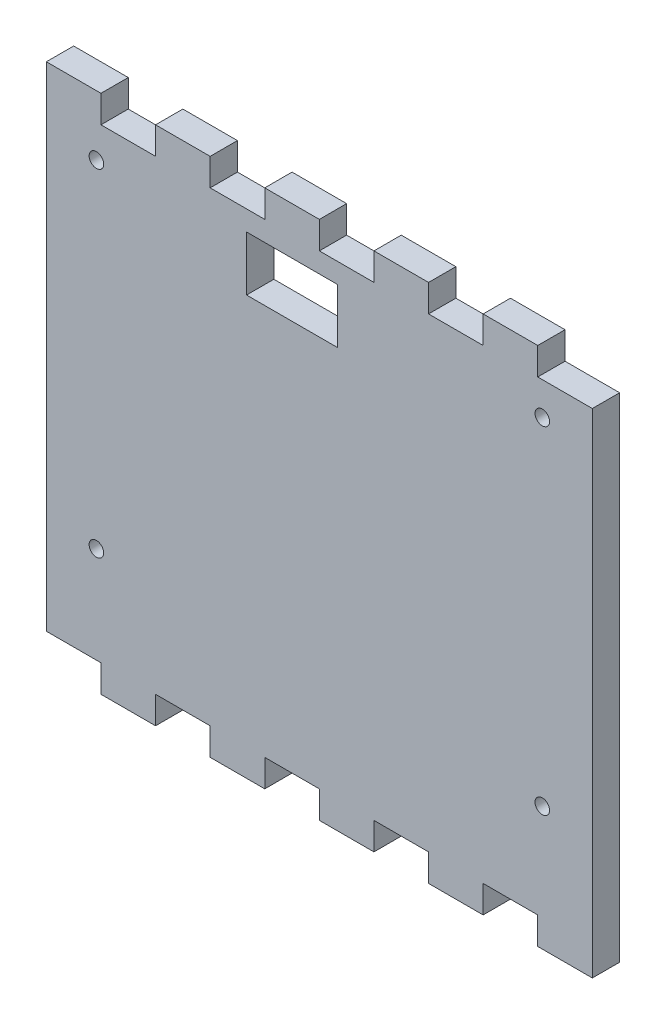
from build123d import *

# Parameters (mm, degrees)
ESQUISSE1_W                = 300
ESQUISSE1_H                = 286
BOSS_EXTRU_1_DEPTH         = 15
ESQUISSE2_W                = 30
ESQUISSE2_H                = 15
ENL_V_MAT_EXTRU_1_DEPTH    = 41
R_P_TITION_LIN_AIRE1_COUNT = 10
R_P_TITION_LIN_AIRE1_PITCH = 60
ESQUISSE3_R                = 4
ENL_V_MAT_EXTRU_2_DEPTH    = 415.754144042
ESQUISSE7_W                = 30
ESQUISSE7_H                = 15
ENL_V_MAT_EXTRU_3_DEPTH    = 415.754144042
R_P_TITION_LIN_AIRE2_COUNT = 5
R_P_TITION_LIN_AIRE2_PITCH = 60
ESQUISSE8_W                = 50
ESQUISSE8_H                = 30
ENL_V_MAT_EXTRU_4_DEPTH    = 415.754144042


with BuildPart() as part:
    # Esquisse1 → Boss.-Extru.1 (new body)
    with BuildSketch(Plane.XY):
        with Locations((150, -143)):
            Rectangle(ESQUISSE1_W, ESQUISSE1_H)
    extrude(amount=BOSS_EXTRU_1_DEPTH)

    # Esquisse2 → Enl_v. mat.-Extru.1 (cut)
    with BuildSketch(Plane.XY.offset(15)):
        with Locations((45, -7.5)):
            Rectangle(ESQUISSE2_W, ESQUISSE2_H)
    enl_v_mat_extru_1 = extrude(amount=-ENL_V_MAT_EXTRU_1_DEPTH, mode=Mode.SUBTRACT)

    # R_p_tition lin_aire1: Enl_v. mat.-Extru.1 ×10
    with Locations(*[(i * R_P_TITION_LIN_AIRE1_PITCH, 0, 0) for i in range(1, R_P_TITION_LIN_AIRE1_COUNT)]):
        add(enl_v_mat_extru_1, mode=Mode.SUBTRACT)

    # Esquisse3 → Enl_v. mat.-Extru.2 (cut, through all)
    with BuildSketch(Plane(origin=(0, 0, 0), x_dir=(-1, 0, 0), z_dir=(0, 0, -1))):
        with Locations((-272.5, -33)):
            Circle(ESQUISSE3_R)
        with Locations((-27.5, -33)):
            Circle(ESQUISSE3_R)
        with Locations((-27.5, -218)):
            Circle(ESQUISSE3_R)
        with Locations((-272.5, -218)):
            Circle(ESQUISSE3_R)
    extrude(amount=-ENL_V_MAT_EXTRU_2_DEPTH, mode=Mode.SUBTRACT)

    # Esquisse7 → Enl_v. mat.-Extru.3 (cut, through all)
    with BuildSketch(Plane(origin=(0, 0, 0), x_dir=(-1, 0, 0), z_dir=(0, 0, -1))):
        with Locations((-255, -278.5)):
            Rectangle(ESQUISSE7_W, ESQUISSE7_H)
    enl_v_mat_extru_3 = extrude(amount=-ENL_V_MAT_EXTRU_3_DEPTH, mode=Mode.SUBTRACT)

    # R_p_tition lin_aire2: Enl_v. mat.-Extru.3 ×5
    with Locations(*[(-i * R_P_TITION_LIN_AIRE2_PITCH, 0, 0) for i in range(1, R_P_TITION_LIN_AIRE2_COUNT)]):
        add(enl_v_mat_extru_3, mode=Mode.SUBTRACT)

    # Esquisse8 → Enl_v. mat.-Extru.4 (cut, through all)
    with BuildSketch(Plane(origin=(0, 0, 0), x_dir=(-1, 0, 0), z_dir=(0, 0, -1))):
        with Locations((-135, -41)):
            Rectangle(ESQUISSE8_W, ESQUISSE8_H)
    extrude(amount=-ENL_V_MAT_EXTRU_4_DEPTH, mode=Mode.SUBTRACT)


solid = part.part
